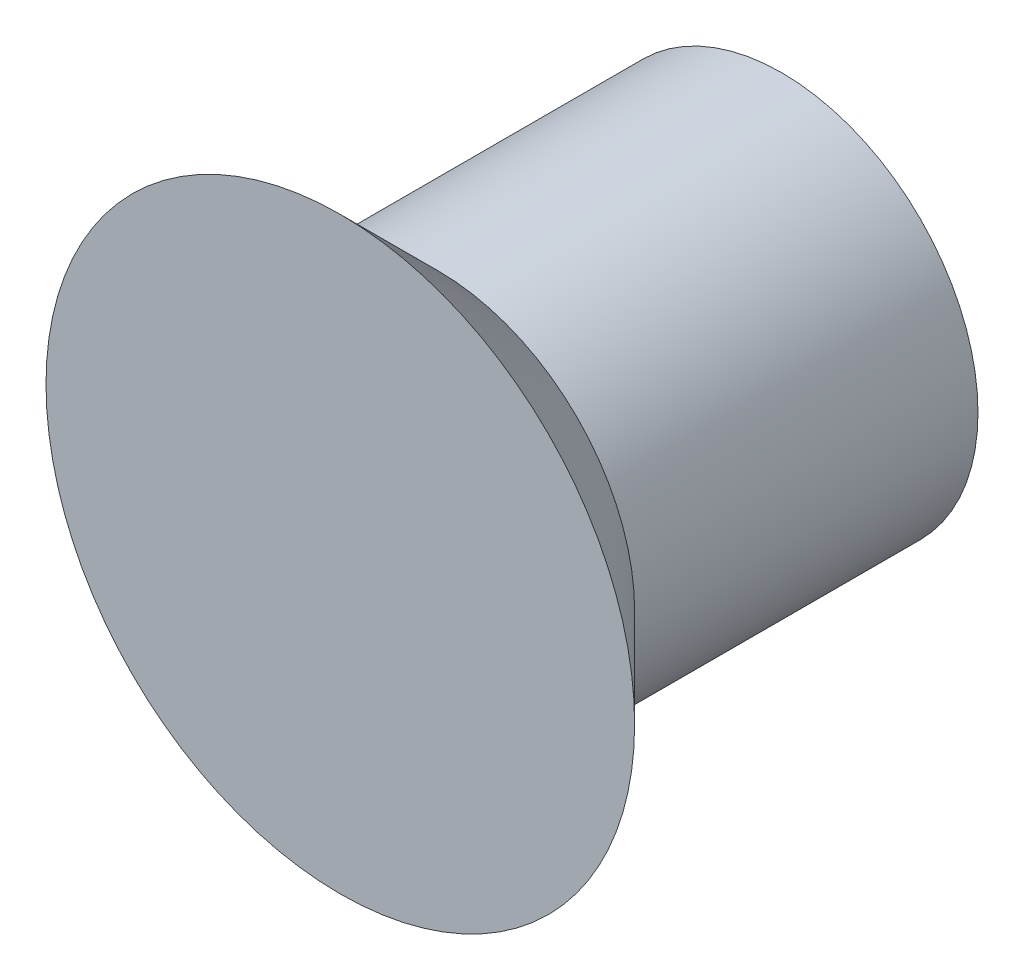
from build123d import *

# Parameters (mm, degrees)
IZIM1_R                     = 2
Y_KSEKLIK_EKSTR_ZYON1_DEPTH = 3.5
IZIM3_R                     = 2
Y_KSEKLIK_EKSTR_ZYON3_DEPTH = 1
Y_KSEKLIK_EKSTR_ZYON3_DRAFT = -45


with BuildPart() as part:
    # izim1 → Y_kseklik-Ekstr_zyon1 (new body)
    with BuildSketch(Plane.XY):
        Circle(IZIM1_R)
    extrude(amount=Y_KSEKLIK_EKSTR_ZYON1_DEPTH)


with BuildPart() as y_kseklik_ekstr_zyon3_tool:
    # izim3 → Y_kseklik-Ekstr_zyon3 (with draft: the straight prism first)
    with BuildSketch(Plane.XY.offset(3.5)):
        Circle(IZIM3_R)
    extrude(amount=Y_KSEKLIK_EKSTR_ZYON3_DEPTH)
    # Y_kseklik-Ekstr_zyon3: the draft: its side faces are tilted about the plane it starts from
    y_kseklik_ekstr_zyon3_sides = [y_kseklik_ekstr_zyon3_tool.faces().sort_by_distance(p)[0] for p in [
        (-2, 0, 4),
    ]]
    draft(y_kseklik_ekstr_zyon3_sides, Plane.XY.offset(3.5), Y_KSEKLIK_EKSTR_ZYON3_DRAFT)


with BuildPart() as part_1:
    add(part.part)

    # Y_kseklik-Ekstr_zyon3: add y_kseklik_ekstr_zyon3_tool
    add(y_kseklik_ekstr_zyon3_tool.part)


solid = part_1.part
